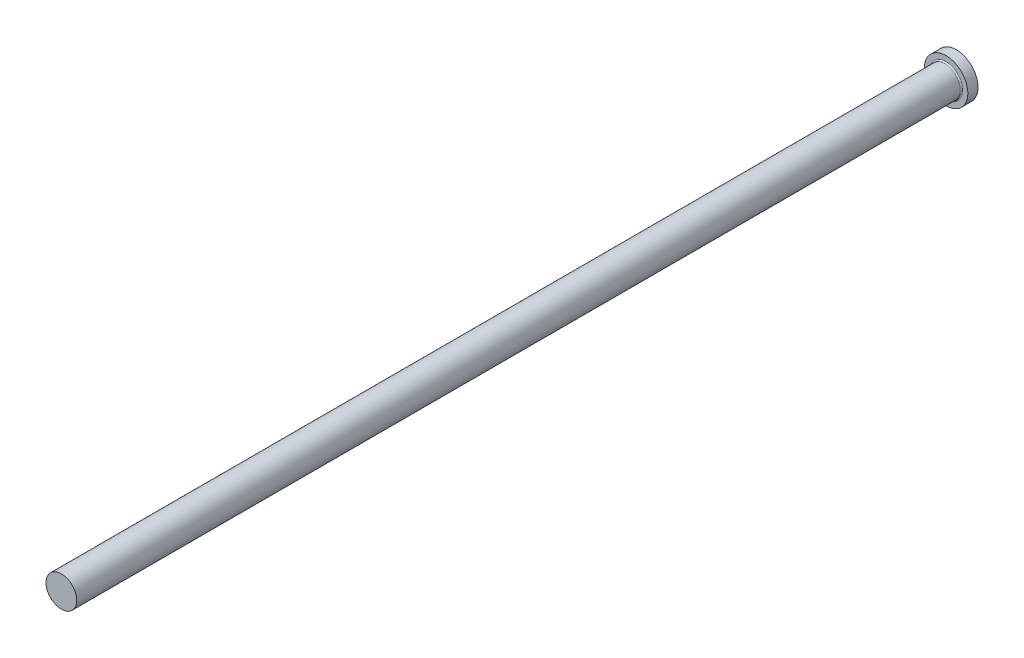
ISO-10303-21;
HEADER;
FILE_DESCRIPTION(('STEP AP214'),'2;1');
FILE_NAME('part.step','',(''),(''),'','','');
FILE_SCHEMA(('AUTOMOTIVE_DESIGN { 1 0 10303 214 1 1 1 1 }'));
ENDSEC;
DATA;
#1=APPLICATION_CONTEXT('core data for automotive mechanical design processes');
#2=APPLICATION_PROTOCOL_DEFINITION('international standard','automotive_design',2000,#1);
#3=PRODUCT_CONTEXT('',#1,'mechanical');
#4=PRODUCT('Part','Part','',(#3));
#5=PRODUCT_RELATED_PRODUCT_CATEGORY('part','',(#4));
#6=PRODUCT_DEFINITION_FORMATION('','',#4);
#7=PRODUCT_DEFINITION_CONTEXT('part definition',#1,'design');
#8=PRODUCT_DEFINITION('design','',#6,#7);
#9=PRODUCT_DEFINITION_SHAPE('','',#8);
#10=(LENGTH_UNIT() NAMED_UNIT(*) SI_UNIT(.MILLI.,.METRE.));
#11=(NAMED_UNIT(*) PLANE_ANGLE_UNIT() SI_UNIT($,.RADIAN.));
#12=(NAMED_UNIT(*) SI_UNIT($,.STERADIAN.) SOLID_ANGLE_UNIT());
#13=UNCERTAINTY_MEASURE_WITH_UNIT(LENGTH_MEASURE(1.E-05),#10,'distance_accuracy_value','');
#14=(GEOMETRIC_REPRESENTATION_CONTEXT(3) GLOBAL_UNCERTAINTY_ASSIGNED_CONTEXT((#13)) GLOBAL_UNIT_ASSIGNED_CONTEXT((#10,
#11,#12)) REPRESENTATION_CONTEXT('',''));
#15=CARTESIAN_POINT('',(0.,0.,0.));
#16=DIRECTION('',(0.,0.,1.));
#17=DIRECTION('',(1.,0.,0.));
#18=AXIS2_PLACEMENT_3D('',#15,#16,#17);
#19=CARTESIAN_POINT('',(8.5,0.,4.));
#20=DIRECTION('',(0.,0.,-1.));
#21=DIRECTION('',(-1.,0.,0.));
#22=AXIS2_PLACEMENT_3D('',#19,#20,#21);
#23=PLANE('',#22);
#24=CARTESIAN_POINT('',(0.,0.,4.));
#25=DIRECTION('',(0.,0.,-1.));
#26=DIRECTION('',(-1.,0.,0.));
#27=AXIS2_PLACEMENT_3D('',#24,#25,#26);
#28=CIRCLE('',#27,6.50000000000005);
#29=CARTESIAN_POINT('',(-6.50000000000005,0.,4.));
#30=VERTEX_POINT('',#29);
#31=EDGE_CURVE('E40',#30,#30,#28,.T.);
#32=ORIENTED_EDGE('',*,*,#31,.T.);
#33=EDGE_LOOP('',(#32));
#34=FACE_BOUND('',#33,.T.);
#35=CARTESIAN_POINT('',(0.,0.,4.));
#36=DIRECTION('',(0.,0.,-1.));
#37=DIRECTION('',(-1.,0.,0.));
#38=AXIS2_PLACEMENT_3D('',#35,#36,#37);
#39=CIRCLE('',#38,8.5);
#40=CARTESIAN_POINT('',(-8.5,0.,4.));
#41=VERTEX_POINT('',#40);
#42=EDGE_CURVE('E44',#41,#41,#39,.T.);
#43=ORIENTED_EDGE('',*,*,#42,.F.);
#44=EDGE_LOOP('',(#43));
#45=FACE_BOUND('',#44,.T.);
#46=ADVANCED_FACE('F33',(#34,#45),#23,.F.);
#47=CARTESIAN_POINT('',(0.,0.,-9.03322817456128));
#48=DIRECTION('',(0.,0.,-1.));
#49=DIRECTION('',(-1.,0.,0.));
#50=AXIS2_PLACEMENT_3D('',#47,#48,#49);
#51=CYLINDRICAL_SURFACE('',#50,8.5);
#52=CARTESIAN_POINT('',(0.,0.,0.));
#53=DIRECTION('',(0.,0.,-1.));
#54=DIRECTION('',(-1.,0.,0.));
#55=AXIS2_PLACEMENT_3D('',#52,#53,#54);
#56=CIRCLE('',#55,8.5);
#57=CARTESIAN_POINT('',(-8.5,0.,0.));
#58=VERTEX_POINT('',#57);
#59=EDGE_CURVE('E48',#58,#58,#56,.T.);
#60=ORIENTED_EDGE('',*,*,#59,.F.);
#61=EDGE_LOOP('',(#60));
#62=FACE_BOUND('',#61,.T.);
#63=ORIENTED_EDGE('',*,*,#42,.T.);
#64=EDGE_LOOP('',(#63));
#65=FACE_BOUND('',#64,.T.);
#66=ADVANCED_FACE('F68',(#62,#65),#51,.T.);
#67=CARTESIAN_POINT('',(0.,0.,0.));
#68=DIRECTION('',(0.,0.,1.));
#69=DIRECTION('',(1.,0.,0.));
#70=AXIS2_PLACEMENT_3D('',#67,#68,#69);
#71=PLANE('',#70);
#72=ORIENTED_EDGE('',*,*,#59,.T.);
#73=EDGE_LOOP('',(#72));
#74=FACE_BOUND('',#73,.T.);
#75=ADVANCED_FACE('F61',(#74),#71,.F.);
#76=CARTESIAN_POINT('',(0.,0.,350.));
#77=DIRECTION('',(0.,0.,-1.));
#78=DIRECTION('',(-1.,0.,0.));
#79=AXIS2_PLACEMENT_3D('',#76,#77,#78);
#80=PLANE('',#79);
#81=CARTESIAN_POINT('',(0.,0.,350.));
#82=DIRECTION('',(0.,0.,-1.));
#83=DIRECTION('',(-1.,0.,0.));
#84=AXIS2_PLACEMENT_3D('',#81,#82,#83);
#85=CIRCLE('',#84,6.0000000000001);
#86=CARTESIAN_POINT('',(-6.00000000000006,0.,350.));
#87=VERTEX_POINT('',#86);
#88=EDGE_CURVE('E53',#87,#87,#85,.T.);
#89=ORIENTED_EDGE('',*,*,#88,.F.);
#90=EDGE_LOOP('',(#89));
#91=FACE_BOUND('',#90,.T.);
#92=ADVANCED_FACE('F59',(#91),#80,.F.);
#93=CARTESIAN_POINT('',(0.,0.,-9.03322817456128));
#94=DIRECTION('',(0.,0.,-1.));
#95=DIRECTION('',(-1.,0.,0.));
#96=AXIS2_PLACEMENT_3D('',#93,#94,#95);
#97=CYLINDRICAL_SURFACE('',#96,6.00000000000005);
#98=CARTESIAN_POINT('',(0.,0.,4.5));
#99=DIRECTION('',(0.,0.,-1.));
#100=DIRECTION('',(-1.,0.,0.));
#101=AXIS2_PLACEMENT_3D('',#98,#99,#100);
#102=CIRCLE('',#101,6.00000000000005);
#103=CARTESIAN_POINT('',(-6.00000000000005,0.,4.5));
#104=VERTEX_POINT('',#103);
#105=EDGE_CURVE('E10',#104,#104,#102,.F.);
#106=ORIENTED_EDGE('',*,*,#105,.T.);
#107=EDGE_LOOP('',(#106));
#108=FACE_BOUND('',#107,.T.);
#109=ORIENTED_EDGE('',*,*,#88,.T.);
#110=EDGE_LOOP('',(#109));
#111=FACE_BOUND('',#110,.T.);
#112=ADVANCED_FACE('F57',(#108,#111),#97,.T.);
#113=CARTESIAN_POINT('',(0.,0.,4.5));
#114=DIRECTION('',(0.,0.,-1.));
#115=DIRECTION('',(-1.,0.,0.));
#116=AXIS2_PLACEMENT_3D('',#113,#114,#115);
#117=TOROIDAL_SURFACE('',#116,6.50000000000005,0.5);
#118=ORIENTED_EDGE('',*,*,#105,.F.);
#119=EDGE_LOOP('',(#118));
#120=FACE_BOUND('',#119,.T.);
#121=ORIENTED_EDGE('',*,*,#31,.F.);
#122=EDGE_LOOP('',(#121));
#123=FACE_BOUND('',#122,.T.);
#124=ADVANCED_FACE('F35',(#120,#123),#117,.F.);
#125=CLOSED_SHELL('',(#46,#66,#75,#92,#112,#124));
#126=MANIFOLD_SOLID_BREP('B2',#125);
#127=ADVANCED_BREP_SHAPE_REPRESENTATION('',(#18,#126),#14);
#128=SHAPE_DEFINITION_REPRESENTATION(#9,#127);
ENDSEC;
END-ISO-10303-21;
